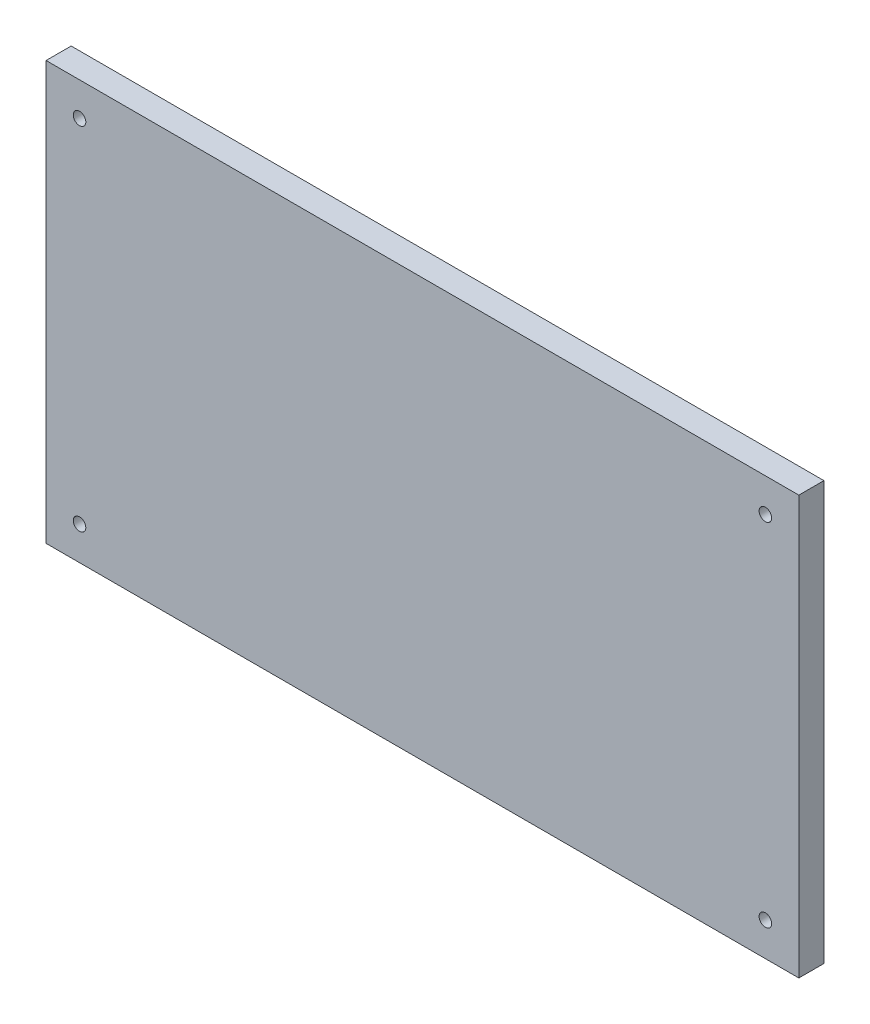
from build123d import *

# Parameters (mm, degrees)
SKETCH1_W           = 450
SKETCH1_H           = 250
BOSS_EXTRUDE1_DEPTH = 15
SKETCH4_R           = 3.75
CUT_EXTRUDE1_DEPTH  = 65


with BuildPart() as part:
    # Sketch1 → Boss-Extrude1 (new body)
    with BuildSketch(Plane.XY):
        with Locations((-45.432692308, 24.399038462)):
            Rectangle(SKETCH1_W, SKETCH1_H)
    extrude(amount=BOSS_EXTRUDE1_DEPTH)

    # Sketch4 → Cut-Extrude1 (cut)
    with BuildSketch(Plane.XY):
        with Locations((159.567307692, 129.399038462)):
            Circle(SKETCH4_R)
        with Locations(Location((159.567307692, -80.600961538, 0), (0, 0, 180))):
            Circle(SKETCH4_R)
        with Locations((-250.432692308, -80.600961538)):
            Circle(SKETCH4_R)
        with Locations(Location((-250.432692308, 129.399038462, 0), (0, 0, 180))):
            Circle(SKETCH4_R)
    extrude(amount=CUT_EXTRUDE1_DEPTH, mode=Mode.SUBTRACT)


solid = part.part
